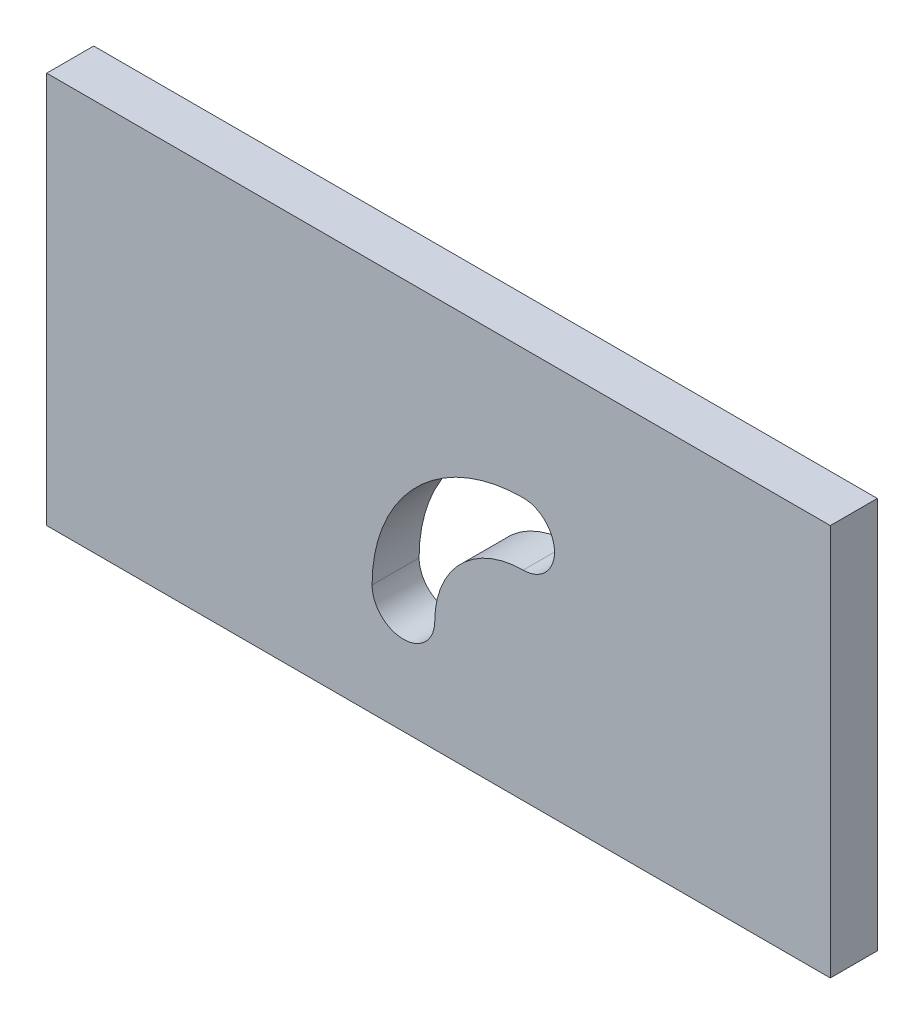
from build123d import *

# Parameters (mm, degrees)
SKETCH1_W      = 50
SKETCH1_H      = 25
EXTRUDE1_DEPTH = 3


with BuildPart() as part:
    # Sketch1 → Extrude1 (new body)
    with BuildSketch(Plane.XY):
        with Locations((25, 12.5)):
            Rectangle(SKETCH1_W, SKETCH1_H)
        with BuildLine():
            ThreePointArc((24.762460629, 7.098102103), (26.414213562, 11.085786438), (30.401897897, 12.737539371))
            ThreePointArc((30.401897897, 12.737539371), (32.401897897, 14.737539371), (30.401897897, 16.737539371))
            ThreePointArc((30.401897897, 16.737539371), (23.585786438, 13.914213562), (20.762460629, 7.098102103))
            ThreePointArc((20.762460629, 7.098102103), (22.762460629, 5.098102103), (24.762460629, 7.098102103))
        make_face(mode=Mode.SUBTRACT)
    extrude(amount=EXTRUDE1_DEPTH)


solid = part.part
